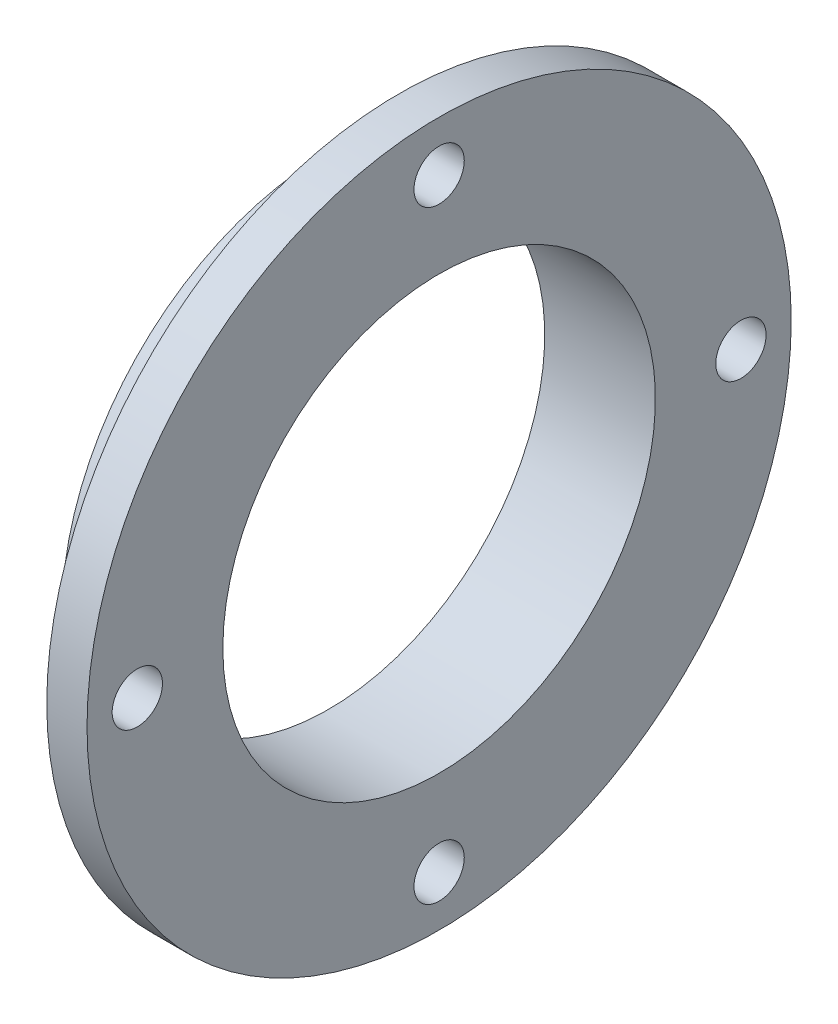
from build123d import *

# Parameters (mm, degrees)
F_10_0_10_DIAMETER_HOLE1_D = 10
CIRPATTERN1_COUNT          = 4


with BuildPart() as part:
    # Sketch1 → Revolve1 (revolve)
    with BuildSketch(Plane.XY, mode=Mode.PRIVATE) as revolve1_sk:
        Polygon((0, 43), (22, 43), (22, 70), (14, 70), (14, 53), (0, 53), align=None)
    revolve(revolve1_sk.sketch.rotate(Axis((0, 0, 0), (1, 0, 0)), 90), axis=Axis((0, 0, 0), (1, 0, 0)))

    # 10.0 _10_ Diameter Hole1 (through all)
    with Locations(Plane(origin=(22, 0, 0), x_dir=(0, 0, -1), z_dir=(1, 0, 0))):
        with Locations((0, 60)):
            f_10_0_10_diameter_hole1 = Hole(F_10_0_10_DIAMETER_HOLE1_D / 2)

    # CirPattern1: 10.0 _10_ Diameter Hole1 ×4 about axis
    cirpattern1_axis = Axis((0, 0, 0), (1, 0, 0))
    for i in range(1, CIRPATTERN1_COUNT):
        add(f_10_0_10_diameter_hole1.rotate(cirpattern1_axis, i * 360 / CIRPATTERN1_COUNT), mode=Mode.SUBTRACT)


solid = part.part
